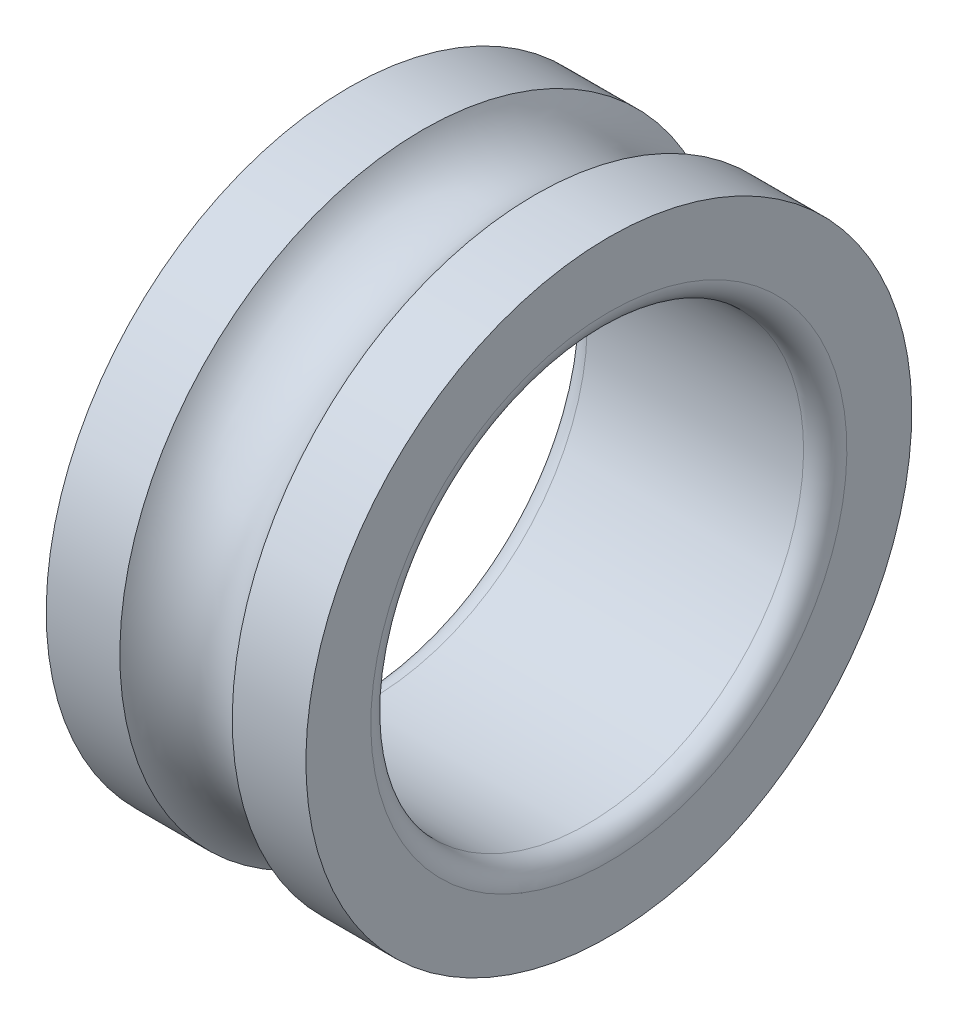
ISO-10303-21;
HEADER;
FILE_DESCRIPTION(('STEP AP214'),'2;1');
FILE_NAME('part.step','',(''),(''),'','','');
FILE_SCHEMA(('AUTOMOTIVE_DESIGN { 1 0 10303 214 1 1 1 1 }'));
ENDSEC;
DATA;
#1=APPLICATION_CONTEXT('core data for automotive mechanical design processes');
#2=APPLICATION_PROTOCOL_DEFINITION('international standard','automotive_design',2000,#1);
#3=PRODUCT_CONTEXT('',#1,'mechanical');
#4=PRODUCT('Part','Part','',(#3));
#5=PRODUCT_RELATED_PRODUCT_CATEGORY('part','',(#4));
#6=PRODUCT_DEFINITION_FORMATION('','',#4);
#7=PRODUCT_DEFINITION_CONTEXT('part definition',#1,'design');
#8=PRODUCT_DEFINITION('design','',#6,#7);
#9=PRODUCT_DEFINITION_SHAPE('','',#8);
#10=(LENGTH_UNIT() NAMED_UNIT(*) SI_UNIT(.MILLI.,.METRE.));
#11=(NAMED_UNIT(*) PLANE_ANGLE_UNIT() SI_UNIT($,.RADIAN.));
#12=(NAMED_UNIT(*) SI_UNIT($,.STERADIAN.) SOLID_ANGLE_UNIT());
#13=UNCERTAINTY_MEASURE_WITH_UNIT(LENGTH_MEASURE(1.E-05),#10,'distance_accuracy_value','');
#14=(GEOMETRIC_REPRESENTATION_CONTEXT(3) GLOBAL_UNCERTAINTY_ASSIGNED_CONTEXT((#13)) GLOBAL_UNIT_ASSIGNED_CONTEXT((#10,
#11,#12)) REPRESENTATION_CONTEXT('',''));
#15=CARTESIAN_POINT('',(0.,0.,0.));
#16=DIRECTION('',(0.,0.,1.));
#17=DIRECTION('',(1.,0.,0.));
#18=AXIS2_PLACEMENT_3D('',#15,#16,#17);
#19=CARTESIAN_POINT('',(5.,98.5,0.));
#20=DIRECTION('',(1.,0.,0.));
#21=DIRECTION('',(0.,1.,0.));
#22=AXIS2_PLACEMENT_3D('',#19,#20,#21);
#23=PLANE('',#22);
#24=CARTESIAN_POINT('',(5.,87.5,0.));
#25=DIRECTION('',(1.,0.,0.));
#26=DIRECTION('',(0.,1.,0.));
#27=AXIS2_PLACEMENT_3D('',#24,#25,#26);
#28=CIRCLE('',#27,14.);
#29=CARTESIAN_POINT('',(5.,101.5,0.));
#30=VERTEX_POINT('',#29);
#31=EDGE_CURVE('E10',#30,#30,#28,.T.);
#32=ORIENTED_EDGE('',*,*,#31,.T.);
#33=EDGE_LOOP('',(#32));
#34=FACE_BOUND('',#33,.T.);
#35=CARTESIAN_POINT('',(4.99999999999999,87.5,0.));
#36=DIRECTION('',(1.,0.,0.));
#37=DIRECTION('',(0.,1.,0.));
#38=AXIS2_PLACEMENT_3D('',#35,#36,#37);
#39=CIRCLE('',#38,11.);
#40=CARTESIAN_POINT('',(4.99999999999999,98.5,0.));
#41=VERTEX_POINT('',#40);
#42=EDGE_CURVE('E58',#41,#41,#39,.T.);
#43=ORIENTED_EDGE('',*,*,#42,.F.);
#44=EDGE_LOOP('',(#43));
#45=FACE_BOUND('',#44,.T.);
#46=ADVANCED_FACE('F30',(#34,#45),#23,.T.);
#47=CARTESIAN_POINT('',(20.,87.5,0.));
#48=DIRECTION('',(1.,0.,0.));
#49=DIRECTION('',(0.,1.,0.));
#50=AXIS2_PLACEMENT_3D('',#47,#48,#49);
#51=CYLINDRICAL_SURFACE('',#50,14.);
#52=CARTESIAN_POINT('',(1.59807621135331,87.5,0.));
#53=DIRECTION('',(1.,0.,0.));
#54=DIRECTION('',(0.,1.,0.));
#55=AXIS2_PLACEMENT_3D('',#52,#53,#54);
#56=CIRCLE('',#55,14.);
#57=CARTESIAN_POINT('',(1.59807621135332,101.5,0.));
#58=VERTEX_POINT('',#57);
#59=EDGE_CURVE('E36',#58,#58,#56,.T.);
#60=ORIENTED_EDGE('',*,*,#59,.T.);
#61=EDGE_LOOP('',(#60));
#62=FACE_BOUND('',#61,.T.);
#63=ORIENTED_EDGE('',*,*,#31,.F.);
#64=EDGE_LOOP('',(#63));
#65=FACE_BOUND('',#64,.T.);
#66=ADVANCED_FACE('F66',(#62,#65),#51,.T.);
#67=CARTESIAN_POINT('',(-1.,87.5,0.));
#68=DIRECTION('',(1.,0.,0.));
#69=DIRECTION('',(0.,1.,0.));
#70=AXIS2_PLACEMENT_3D('',#67,#68,#69);
#71=TOROIDAL_SURFACE('',#70,15.5,3.);
#72=CARTESIAN_POINT('',(-3.59807621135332,87.5,0.));
#73=DIRECTION('',(1.,0.,0.));
#74=DIRECTION('',(0.,1.,0.));
#75=AXIS2_PLACEMENT_3D('',#72,#73,#74);
#76=CIRCLE('',#75,14.);
#77=CARTESIAN_POINT('',(-3.59807621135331,101.5,0.));
#78=VERTEX_POINT('',#77);
#79=EDGE_CURVE('E40',#78,#78,#76,.T.);
#80=ORIENTED_EDGE('',*,*,#79,.T.);
#81=EDGE_LOOP('',(#80));
#82=FACE_BOUND('',#81,.T.);
#83=ORIENTED_EDGE('',*,*,#59,.F.);
#84=EDGE_LOOP('',(#83));
#85=FACE_BOUND('',#84,.T.);
#86=ADVANCED_FACE('F70',(#82,#85),#71,.F.);
#87=CARTESIAN_POINT('',(20.,87.5,0.));
#88=DIRECTION('',(1.,0.,0.));
#89=DIRECTION('',(0.,1.,0.));
#90=AXIS2_PLACEMENT_3D('',#87,#88,#89);
#91=CYLINDRICAL_SURFACE('',#90,14.);
#92=CARTESIAN_POINT('',(-7.,87.5,0.));
#93=DIRECTION('',(1.,0.,0.));
#94=DIRECTION('',(0.,1.,0.));
#95=AXIS2_PLACEMENT_3D('',#92,#93,#94);
#96=CIRCLE('',#95,14.);
#97=CARTESIAN_POINT('',(-7.,101.5,0.));
#98=VERTEX_POINT('',#97);
#99=EDGE_CURVE('E44',#98,#98,#96,.T.);
#100=ORIENTED_EDGE('',*,*,#99,.T.);
#101=EDGE_LOOP('',(#100));
#102=FACE_BOUND('',#101,.T.);
#103=ORIENTED_EDGE('',*,*,#79,.F.);
#104=EDGE_LOOP('',(#103));
#105=FACE_BOUND('',#104,.T.);
#106=ADVANCED_FACE('F74',(#102,#105),#91,.T.);
#107=CARTESIAN_POINT('',(-7.,98.5,0.));
#108=DIRECTION('',(-1.,0.,0.));
#109=DIRECTION('',(0.,-1.,0.));
#110=AXIS2_PLACEMENT_3D('',#107,#108,#109);
#111=PLANE('',#110);
#112=CARTESIAN_POINT('',(-7.,87.5,0.));
#113=DIRECTION('',(1.,0.,0.));
#114=DIRECTION('',(0.,1.,0.));
#115=AXIS2_PLACEMENT_3D('',#112,#113,#114);
#116=CIRCLE('',#115,11.);
#117=CARTESIAN_POINT('',(-7.,98.5,0.));
#118=VERTEX_POINT('',#117);
#119=EDGE_CURVE('E49',#118,#118,#116,.T.);
#120=ORIENTED_EDGE('',*,*,#119,.T.);
#121=EDGE_LOOP('',(#120));
#122=FACE_BOUND('',#121,.T.);
#123=ORIENTED_EDGE('',*,*,#99,.F.);
#124=EDGE_LOOP('',(#123));
#125=FACE_BOUND('',#124,.T.);
#126=ADVANCED_FACE('F81',(#122,#125),#111,.T.);
#127=CARTESIAN_POINT('',(-6.,87.5,0.));
#128=DIRECTION('',(1.,0.,0.));
#129=DIRECTION('',(0.,1.,0.));
#130=AXIS2_PLACEMENT_3D('',#127,#128,#129);
#131=TOROIDAL_SURFACE('',#130,11.,1.);
#132=CARTESIAN_POINT('',(-6.,87.5,0.));
#133=DIRECTION('',(1.,0.,0.));
#134=DIRECTION('',(0.,1.,0.));
#135=AXIS2_PLACEMENT_3D('',#132,#133,#134);
#136=CIRCLE('',#135,9.99999999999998);
#137=CARTESIAN_POINT('',(-5.99999999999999,97.5,0.));
#138=VERTEX_POINT('',#137);
#139=EDGE_CURVE('E52',#138,#138,#136,.T.);
#140=ORIENTED_EDGE('',*,*,#139,.T.);
#141=EDGE_LOOP('',(#140));
#142=FACE_BOUND('',#141,.T.);
#143=ORIENTED_EDGE('',*,*,#119,.F.);
#144=EDGE_LOOP('',(#143));
#145=FACE_BOUND('',#144,.T.);
#146=ADVANCED_FACE('F85',(#142,#145),#131,.T.);
#147=CARTESIAN_POINT('',(20.,87.5,0.));
#148=DIRECTION('',(1.,0.,0.));
#149=DIRECTION('',(0.,1.,0.));
#150=AXIS2_PLACEMENT_3D('',#147,#148,#149);
#151=CYLINDRICAL_SURFACE('',#150,9.99999999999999);
#152=CARTESIAN_POINT('',(4.,87.5,0.));
#153=DIRECTION('',(1.,0.,0.));
#154=DIRECTION('',(0.,1.,0.));
#155=AXIS2_PLACEMENT_3D('',#152,#153,#154);
#156=CIRCLE('',#155,10.);
#157=CARTESIAN_POINT('',(4.00000000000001,97.5,0.));
#158=VERTEX_POINT('',#157);
#159=EDGE_CURVE('E55',#158,#158,#156,.T.);
#160=ORIENTED_EDGE('',*,*,#159,.T.);
#161=EDGE_LOOP('',(#160));
#162=FACE_BOUND('',#161,.T.);
#163=ORIENTED_EDGE('',*,*,#139,.F.);
#164=EDGE_LOOP('',(#163));
#165=FACE_BOUND('',#164,.T.);
#166=ADVANCED_FACE('F89',(#162,#165),#151,.F.);
#167=CARTESIAN_POINT('',(4.,87.5,0.));
#168=DIRECTION('',(1.,0.,0.));
#169=DIRECTION('',(0.,1.,0.));
#170=AXIS2_PLACEMENT_3D('',#167,#168,#169);
#171=TOROIDAL_SURFACE('',#170,11.,0.999999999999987);
#172=ORIENTED_EDGE('',*,*,#42,.T.);
#173=EDGE_LOOP('',(#172));
#174=FACE_BOUND('',#173,.T.);
#175=ORIENTED_EDGE('',*,*,#159,.F.);
#176=EDGE_LOOP('',(#175));
#177=FACE_BOUND('',#176,.T.);
#178=ADVANCED_FACE('F62',(#174,#177),#171,.T.);
#179=CLOSED_SHELL('',(#46,#66,#86,#106,#126,#146,#166,#178));
#180=MANIFOLD_SOLID_BREP('B2',#179);
#181=ADVANCED_BREP_SHAPE_REPRESENTATION('',(#18,#180),#14);
#182=SHAPE_DEFINITION_REPRESENTATION(#9,#181);
ENDSEC;
END-ISO-10303-21;
